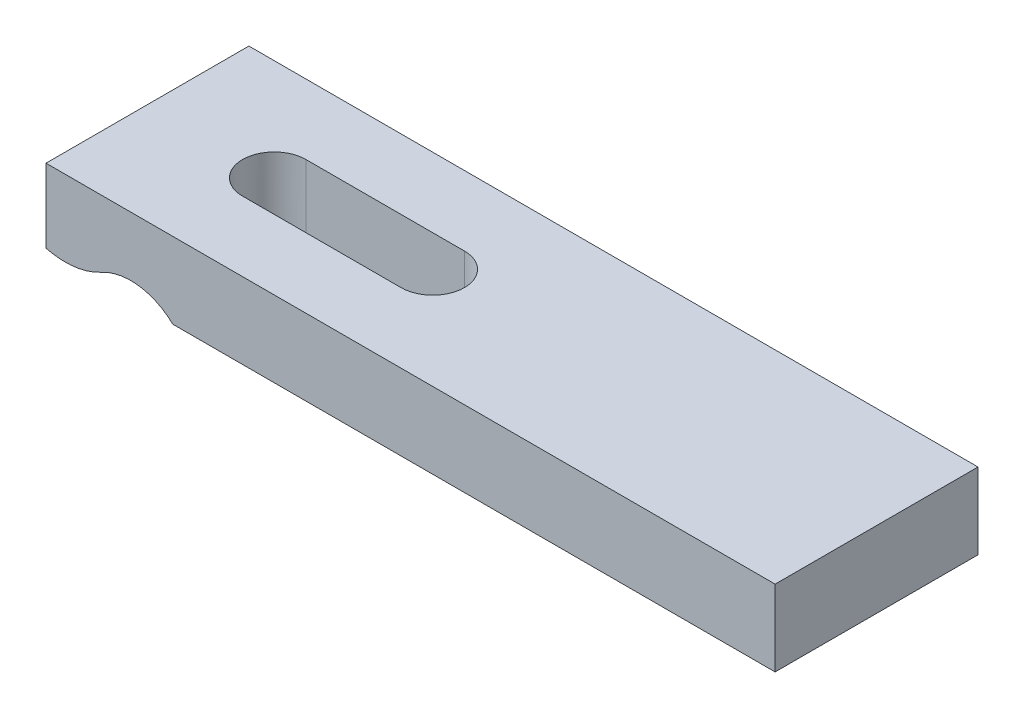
ISO-10303-21;
HEADER;
FILE_DESCRIPTION(('STEP AP214'),'2;1');
FILE_NAME('part.step','',(''),(''),'','','');
FILE_SCHEMA(('AUTOMOTIVE_DESIGN { 1 0 10303 214 1 1 1 1 }'));
ENDSEC;
DATA;
#1=APPLICATION_CONTEXT('core data for automotive mechanical design processes');
#2=APPLICATION_PROTOCOL_DEFINITION('international standard','automotive_design',2000,#1);
#3=PRODUCT_CONTEXT('',#1,'mechanical');
#4=PRODUCT('Part','Part','',(#3));
#5=PRODUCT_RELATED_PRODUCT_CATEGORY('part','',(#4));
#6=PRODUCT_DEFINITION_FORMATION('','',#4);
#7=PRODUCT_DEFINITION_CONTEXT('part definition',#1,'design');
#8=PRODUCT_DEFINITION('design','',#6,#7);
#9=PRODUCT_DEFINITION_SHAPE('','',#8);
#10=(LENGTH_UNIT() NAMED_UNIT(*) SI_UNIT(.MILLI.,.METRE.));
#11=(NAMED_UNIT(*) PLANE_ANGLE_UNIT() SI_UNIT($,.RADIAN.));
#12=(NAMED_UNIT(*) SI_UNIT($,.STERADIAN.) SOLID_ANGLE_UNIT());
#13=UNCERTAINTY_MEASURE_WITH_UNIT(LENGTH_MEASURE(1.E-05),#10,'distance_accuracy_value','');
#14=(GEOMETRIC_REPRESENTATION_CONTEXT(3) GLOBAL_UNCERTAINTY_ASSIGNED_CONTEXT((#13)) GLOBAL_UNIT_ASSIGNED_CONTEXT((#10,
#11,#12)) REPRESENTATION_CONTEXT('',''));
#15=CARTESIAN_POINT('',(0.,0.,0.));
#16=DIRECTION('',(0.,0.,1.));
#17=DIRECTION('',(1.,0.,0.));
#18=AXIS2_PLACEMENT_3D('',#15,#16,#17);
#19=CARTESIAN_POINT('',(0.,0.,32.));
#20=DIRECTION('',(1.,0.,0.));
#21=DIRECTION('',(0.,1.,0.));
#22=AXIS2_PLACEMENT_3D('',#19,#20,#21);
#23=PLANE('',#22);
#24=DIRECTION('',(0.,-1.,0.));
#25=VECTOR('',#24,1.);
#26=CARTESIAN_POINT('',(0.,0.,0.));
#27=LINE('',#26,#25);
#28=CARTESIAN_POINT('',(0.,0.,0.));
#29=VERTEX_POINT('',#28);
#30=CARTESIAN_POINT('',(0.,-11.6189500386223,0.));
#31=VERTEX_POINT('',#30);
#32=EDGE_CURVE('E161',#29,#31,#27,.T.);
#33=ORIENTED_EDGE('',*,*,#32,.T.);
#34=DIRECTION('',(0.,0.,-1.));
#35=VECTOR('',#34,1.);
#36=CARTESIAN_POINT('',(0.,-11.6189500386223,32.));
#37=LINE('',#36,#35);
#38=CARTESIAN_POINT('',(0.,-11.6189500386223,32.));
#39=VERTEX_POINT('',#38);
#40=EDGE_CURVE('E11',#39,#31,#37,.T.);
#41=ORIENTED_EDGE('',*,*,#40,.F.);
#42=DIRECTION('',(0.,-1.,0.));
#43=VECTOR('',#42,1.);
#44=CARTESIAN_POINT('',(0.,0.,32.));
#45=LINE('',#44,#43);
#46=CARTESIAN_POINT('',(0.,0.,32.));
#47=VERTEX_POINT('',#46);
#48=EDGE_CURVE('E162',#47,#39,#45,.T.);
#49=ORIENTED_EDGE('',*,*,#48,.F.);
#50=DIRECTION('',(0.,0.,-1.));
#51=VECTOR('',#50,1.);
#52=CARTESIAN_POINT('',(0.,0.,32.));
#53=LINE('',#52,#51);
#54=EDGE_CURVE('E206',#47,#29,#53,.T.);
#55=ORIENTED_EDGE('',*,*,#54,.T.);
#56=EDGE_LOOP('',(#33,#41,#49,#55));
#57=FACE_BOUND('',#56,.T.);
#58=ADVANCED_FACE('F31',(#57),#23,.F.);
#59=CARTESIAN_POINT('',(3.,0.,32.));
#60=DIRECTION('',(0.,0.,-1.));
#61=DIRECTION('',(-1.,0.,0.));
#62=AXIS2_PLACEMENT_3D('',#59,#60,#61);
#63=CYLINDRICAL_SURFACE('',#62,12.);
#64=CARTESIAN_POINT('',(3.,0.,0.));
#65=DIRECTION('',(0.,0.,1.));
#66=DIRECTION('',(1.,0.,0.));
#67=AXIS2_PLACEMENT_3D('',#64,#65,#66);
#68=CIRCLE('',#67,12.);
#69=CARTESIAN_POINT('',(8.7617013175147,-10.5262907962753,0.));
#70=VERTEX_POINT('',#69);
#71=EDGE_CURVE('E208',#31,#70,#68,.T.);
#72=ORIENTED_EDGE('',*,*,#71,.T.);
#73=DIRECTION('',(0.,0.,-1.));
#74=VECTOR('',#73,1.);
#75=CARTESIAN_POINT('',(8.7617013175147,-10.5262907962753,32.));
#76=LINE('',#75,#74);
#77=CARTESIAN_POINT('',(8.7617013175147,-10.5262907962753,32.));
#78=VERTEX_POINT('',#77);
#79=EDGE_CURVE('E38',#78,#70,#76,.T.);
#80=ORIENTED_EDGE('',*,*,#79,.F.);
#81=CARTESIAN_POINT('',(3.,0.,32.));
#82=DIRECTION('',(0.,0.,1.));
#83=DIRECTION('',(1.,0.,0.));
#84=AXIS2_PLACEMENT_3D('',#81,#82,#83);
#85=CIRCLE('',#84,12.);
#86=EDGE_CURVE('E248',#39,#78,#85,.T.);
#87=ORIENTED_EDGE('',*,*,#86,.F.);
#88=ORIENTED_EDGE('',*,*,#40,.T.);
#89=EDGE_LOOP('',(#72,#80,#87,#88));
#90=FACE_BOUND('',#89,.T.);
#91=ADVANCED_FACE('F192',(#90),#63,.T.);
#92=CARTESIAN_POINT('',(13.3710623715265,-18.9473234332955,32.));
#93=DIRECTION('',(0.,0.,-1.));
#94=DIRECTION('',(-1.,0.,0.));
#95=AXIS2_PLACEMENT_3D('',#92,#93,#94);
#96=CYLINDRICAL_SURFACE('',#95,9.6);
#97=DIRECTION('',(0.,0.,-1.));
#98=VECTOR('',#97,1.);
#99=CARTESIAN_POINT('',(19.9963696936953,-12.,32.));
#100=LINE('',#99,#98);
#101=CARTESIAN_POINT('',(19.9963696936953,-12.,11.0000013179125));
#102=VERTEX_POINT('',#101);
#103=CARTESIAN_POINT('',(19.9963696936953,-12.,0.));
#104=VERTEX_POINT('',#103);
#105=EDGE_CURVE('E231',#102,#104,#100,.T.);
#106=ORIENTED_EDGE('',*,*,#105,.F.);
#107=CARTESIAN_POINT('',(19.9963696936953,-12.,11.0000013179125));
#108=CARTESIAN_POINT('',(19.8813083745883,-11.8902365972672,11.0000797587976));
#109=CARTESIAN_POINT('',(19.7634393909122,-11.7833250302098,11.004143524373));
#110=CARTESIAN_POINT('',(19.5228037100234,-11.5756727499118,11.0213614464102));
#111=CARTESIAN_POINT('',(19.4000316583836,-11.4749391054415,11.0345258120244));
#112=CARTESIAN_POINT('',(19.1497850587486,-11.2797470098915,11.0711844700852));
#113=CARTESIAN_POINT('',(19.0222857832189,-11.1853320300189,11.0947432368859));
#114=CARTESIAN_POINT('',(18.7645717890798,-11.0040966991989,11.1532313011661));
#115=CARTESIAN_POINT('',(18.634358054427,-10.9172736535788,11.1881565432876));
#116=CARTESIAN_POINT('',(18.3716238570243,-10.7510600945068,11.2705722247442));
#117=CARTESIAN_POINT('',(18.2390933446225,-10.6717322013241,11.3181576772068));
#118=CARTESIAN_POINT('',(17.9744699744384,-10.5216616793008,11.4264170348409));
#119=CARTESIAN_POINT('',(17.8423771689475,-10.4509200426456,11.487092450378));
#120=CARTESIAN_POINT('',(17.5811148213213,-10.318486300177,11.6215873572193));
#121=CARTESIAN_POINT('',(17.4519360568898,-10.2567607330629,11.6953558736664));
#122=CARTESIAN_POINT('',(17.1980466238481,-10.1420071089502,11.856134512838));
#123=CARTESIAN_POINT('',(17.0733351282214,-10.0889774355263,11.9431421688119));
#124=CARTESIAN_POINT('',(16.8480314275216,-9.99840007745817,12.1164104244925));
#125=CARTESIAN_POINT('',(16.7465640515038,-9.95972245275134,12.2009498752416));
#126=CARTESIAN_POINT('',(16.5495654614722,-9.88817895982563,12.3789341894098));
#127=CARTESIAN_POINT('',(16.4540339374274,-9.8553127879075,12.4723785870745));
#128=CARTESIAN_POINT('',(16.2699197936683,-9.7949452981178,12.6676541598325));
#129=CARTESIAN_POINT('',(16.1813437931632,-9.76744905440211,12.7694931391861));
#130=CARTESIAN_POINT('',(16.0122104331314,-9.7173657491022,12.9807545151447));
#131=CARTESIAN_POINT('',(15.931653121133,-9.69477871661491,13.0901769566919));
#132=CARTESIAN_POINT('',(15.7825603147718,-9.6548325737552,13.3110934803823));
#133=CARTESIAN_POINT('',(15.7136643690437,-9.63729522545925,13.4223125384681));
#134=CARTESIAN_POINT('',(15.5846008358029,-9.60576768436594,13.6502325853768));
#135=CARTESIAN_POINT('',(15.5244361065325,-9.59177865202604,13.7669353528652));
#136=CARTESIAN_POINT('',(15.4134043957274,-9.56691429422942,14.0049131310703));
#137=CARTESIAN_POINT('',(15.362531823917,-9.55603709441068,14.126185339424));
#138=CARTESIAN_POINT('',(15.2704280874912,-9.53697681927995,14.3725920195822));
#139=CARTESIAN_POINT('',(15.2292005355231,-9.52879475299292,14.497727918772));
#140=CARTESIAN_POINT('',(15.1556918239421,-9.51458570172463,14.7545968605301));
#141=CARTESIAN_POINT('',(15.123699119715,-9.50862678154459,14.8864162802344));
#142=CARTESIAN_POINT('',(15.0705103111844,-9.49890513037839,15.1523414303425));
#143=CARTESIAN_POINT('',(15.0493180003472,-9.49514317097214,15.2864479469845));
#144=CARTESIAN_POINT('',(15.0179061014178,-9.48961965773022,15.5559843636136));
#145=CARTESIAN_POINT('',(15.007686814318,-9.48785815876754,15.6914142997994));
#146=CARTESIAN_POINT('',(14.9982979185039,-9.48623855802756,15.9626683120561));
#147=CARTESIAN_POINT('',(14.9991284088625,-9.4863804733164,16.0984923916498));
#148=CARTESIAN_POINT('',(15.011953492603,-9.48859622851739,16.3721685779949));
#149=CARTESIAN_POINT('',(15.024158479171,-9.49070647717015,16.5100105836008));
#150=CARTESIAN_POINT('',(15.0599331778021,-9.49703008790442,16.7841152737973));
#151=CARTESIAN_POINT('',(15.0834990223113,-9.50124273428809,16.9203784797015));
#152=CARTESIAN_POINT('',(15.1418193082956,-9.51200157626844,17.1904503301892));
#153=CARTESIAN_POINT('',(15.1765779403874,-9.51854864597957,17.3242580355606));
#154=CARTESIAN_POINT('',(15.2569836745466,-9.53430176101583,17.5883450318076));
#155=CARTESIAN_POINT('',(15.3026265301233,-9.54350676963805,17.7186256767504));
#156=CARTESIAN_POINT('',(15.4043334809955,-9.56497281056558,17.9745312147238));
#157=CARTESIAN_POINT('',(15.4603792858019,-9.57722849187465,18.1001638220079));
#158=CARTESIAN_POINT('',(15.5824229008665,-9.60527863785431,18.346026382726));
#159=CARTESIAN_POINT('',(15.6484167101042,-9.62107168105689,18.4662584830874));
#160=CARTESIAN_POINT('',(15.7897621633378,-9.65672594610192,18.700483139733));
#161=CARTESIAN_POINT('',(15.8651151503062,-9.67658775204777,18.8144747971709));
#162=CARTESIAN_POINT('',(16.0244150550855,-9.72091833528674,19.0353354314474));
#163=CARTESIAN_POINT('',(16.1083617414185,-9.74538698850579,19.1422046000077));
#164=CARTESIAN_POINT('',(16.2818469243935,-9.79880612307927,19.3455597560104));
#165=CARTESIAN_POINT('',(16.3712030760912,-9.82763507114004,19.442233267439));
#166=CARTESIAN_POINT('',(16.5562901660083,-9.89062005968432,19.6273953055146));
#167=CARTESIAN_POINT('',(16.6520209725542,-9.92477599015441,19.7158840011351));
#168=CARTESIAN_POINT('',(16.848699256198,-9.99874439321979,19.8840740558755));
#169=CARTESIAN_POINT('',(16.9496418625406,-10.0385516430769,19.9637834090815));
#170=CARTESIAN_POINT('',(17.1556744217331,-10.1241068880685,20.1141311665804));
#171=CARTESIAN_POINT('',(17.2607643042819,-10.1698547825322,20.1847697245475));
#172=CARTESIAN_POINT('',(17.4714399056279,-10.2663088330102,20.3152500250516));
#173=CARTESIAN_POINT('',(17.5769584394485,-10.3168764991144,20.3753029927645));
#174=CARTESIAN_POINT('',(17.7897433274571,-10.4238591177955,20.4865561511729));
#175=CARTESIAN_POINT('',(17.8970103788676,-10.4802764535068,20.5377527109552));
#176=CARTESIAN_POINT('',(18.1123937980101,-10.5989747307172,20.6314972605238));
#177=CARTESIAN_POINT('',(18.220511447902,-10.6612673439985,20.6740274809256));
#178=CARTESIAN_POINT('',(18.436343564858,-10.791417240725,20.7505882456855));
#179=CARTESIAN_POINT('',(18.5440581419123,-10.8592728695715,20.784621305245));
#180=CARTESIAN_POINT('',(18.7689641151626,-11.0073894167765,20.8476304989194));
#181=CARTESIAN_POINT('',(18.8860231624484,-11.088212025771,20.8757577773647));
#182=CARTESIAN_POINT('',(19.1176270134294,-11.2559350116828,20.9229455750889));
#183=CARTESIAN_POINT('',(19.2321709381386,-11.3428374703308,20.9420029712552));
#184=CARTESIAN_POINT('',(19.4574019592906,-11.5218897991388,20.9717642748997));
#185=CARTESIAN_POINT('',(19.5681029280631,-11.6140167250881,20.982502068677));
#186=CARTESIAN_POINT('',(19.7854219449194,-11.8033173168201,20.9965795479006));
#187=CARTESIAN_POINT('',(19.8920436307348,-11.900486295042,20.9999259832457));
#188=CARTESIAN_POINT('',(19.9963696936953,-12.,20.9999986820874));
#189=B_SPLINE_CURVE_WITH_KNOTS('',3,(#107,#108,#109,#110,#111,#112,#113,#114,#115,#116,#117,
#118,#119,#120,#121,#122,#123,#124,#125,#126,#127,#128,#129,#130,#131,#132,#133,#134,#135,#136,
#137,#138,#139,#140,#141,#142,#143,#144,#145,#146,#147,#148,#149,#150,#151,#152,#153,#154,#155,
#156,#157,#158,#159,#160,#161,#162,#163,#164,#165,#166,#167,#168,#169,#170,#171,#172,#173,#174,
#175,#176,#177,#178,#179,#180,#181,#182,#183,#184,#185,#186,#187,#188),.UNSPECIFIED.,.F.,.F.,(4,
2,2,2,2,2,2,2,2,2,2,2,2,2,2,2,2,2,2,2,2,2,2,2,2,2,2,2,2,2,2,2,2,2,2,2,2,2,2,2,4),(0.,
0.477056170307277,0.954648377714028,1.43524557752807,1.91567149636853,2.39980995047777,
2.88400429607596,3.36635332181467,3.84861258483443,4.26094157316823,4.67324900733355,
5.08594417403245,5.49864178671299,5.89419032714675,6.28986806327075,6.68530696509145,
7.08089374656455,7.48775461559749,7.8947582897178,8.30177312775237,8.70879161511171,
9.12349135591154,9.5380500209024,9.95276407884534,10.3673165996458,10.7811470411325,
11.1948114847,11.6085353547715,12.0222480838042,12.4260408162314,12.8298252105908,
13.23323884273,13.6366456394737,14.0307598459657,14.4250352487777,14.8201111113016,
15.2150698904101,15.6496187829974,16.0843171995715,16.5172356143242,16.9497585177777),.UNSPECIFIED.);
#190=CARTESIAN_POINT('',(19.9963696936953,-12.,20.9999986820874));
#191=VERTEX_POINT('',#190);
#192=EDGE_CURVE('E151',#102,#191,#189,.T.);
#193=ORIENTED_EDGE('',*,*,#192,.T.);
#194=CARTESIAN_POINT('',(19.9963696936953,-12.,32.));
#195=VERTEX_POINT('',#194);
#196=EDGE_CURVE('E134',#195,#191,#100,.T.);
#197=ORIENTED_EDGE('',*,*,#196,.F.);
#198=CARTESIAN_POINT('',(13.3710623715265,-18.9473234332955,32.));
#199=DIRECTION('',(0.,0.,-1.));
#200=DIRECTION('',(-1.,0.,0.));
#201=AXIS2_PLACEMENT_3D('',#198,#199,#200);
#202=CIRCLE('',#201,9.6);
#203=EDGE_CURVE('E238',#78,#195,#202,.T.);
#204=ORIENTED_EDGE('',*,*,#203,.F.);
#205=ORIENTED_EDGE('',*,*,#79,.T.);
#206=CARTESIAN_POINT('',(13.3710623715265,-18.9473234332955,0.));
#207=DIRECTION('',(0.,0.,-1.));
#208=DIRECTION('',(-1.,0.,0.));
#209=AXIS2_PLACEMENT_3D('',#206,#207,#208);
#210=CIRCLE('',#209,9.6);
#211=EDGE_CURVE('E210',#70,#104,#210,.T.);
#212=ORIENTED_EDGE('',*,*,#211,.T.);
#213=EDGE_LOOP('',(#106,#193,#197,#204,#205,#212));
#214=FACE_BOUND('',#213,.T.);
#215=ADVANCED_FACE('F164',(#214),#96,.F.);
#216=CARTESIAN_POINT('',(19.9963696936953,-12.,32.));
#217=DIRECTION('',(0.,1.,0.));
#218=DIRECTION('',(0.,0.,1.));
#219=AXIS2_PLACEMENT_3D('',#216,#217,#218);
#220=PLANE('',#219);
#221=DIRECTION('',(-1.,0.,0.));
#222=VECTOR('',#221,1.);
#223=CARTESIAN_POINT('',(20.,-12.,11.));
#224=LINE('',#223,#222);
#225=CARTESIAN_POINT('',(45.,-12.,11.));
#226=VERTEX_POINT('',#225);
#227=CARTESIAN_POINT('',(20.,-12.,11.));
#228=VERTEX_POINT('',#227);
#229=EDGE_CURVE('E121',#226,#228,#224,.T.);
#230=ORIENTED_EDGE('',*,*,#229,.T.);
#231=CARTESIAN_POINT('',(20.,-12.,16.));
#232=DIRECTION('',(0.,1.,0.));
#233=DIRECTION('',(0.,0.,1.));
#234=AXIS2_PLACEMENT_3D('',#231,#232,#233);
#235=CIRCLE('',#234,5.);
#236=EDGE_CURVE('E127',#228,#102,#235,.T.);
#237=ORIENTED_EDGE('',*,*,#236,.T.);
#238=ORIENTED_EDGE('',*,*,#105,.T.);
#239=DIRECTION('',(1.,0.,0.));
#240=VECTOR('',#239,1.);
#241=CARTESIAN_POINT('',(19.9963696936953,-12.,0.));
#242=LINE('',#241,#240);
#243=CARTESIAN_POINT('',(115.,-12.,0.));
#244=VERTEX_POINT('',#243);
#245=EDGE_CURVE('E218',#104,#244,#242,.T.);
#246=ORIENTED_EDGE('',*,*,#245,.T.);
#247=DIRECTION('',(0.,0.,-1.));
#248=VECTOR('',#247,1.);
#249=CARTESIAN_POINT('',(115.,-12.,32.));
#250=LINE('',#249,#248);
#251=CARTESIAN_POINT('',(115.,-12.,32.));
#252=VERTEX_POINT('',#251);
#253=EDGE_CURVE('E228',#252,#244,#250,.T.);
#254=ORIENTED_EDGE('',*,*,#253,.F.);
#255=DIRECTION('',(1.,0.,0.));
#256=VECTOR('',#255,1.);
#257=CARTESIAN_POINT('',(19.9963696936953,-12.,32.));
#258=LINE('',#257,#256);
#259=EDGE_CURVE('E245',#195,#252,#258,.T.);
#260=ORIENTED_EDGE('',*,*,#259,.F.);
#261=ORIENTED_EDGE('',*,*,#196,.T.);
#262=CARTESIAN_POINT('',(20.,-12.,21.));
#263=VERTEX_POINT('',#262);
#264=EDGE_CURVE('E115',#191,#263,#235,.T.);
#265=ORIENTED_EDGE('',*,*,#264,.T.);
#266=DIRECTION('',(1.,0.,0.));
#267=VECTOR('',#266,1.);
#268=CARTESIAN_POINT('',(20.,-12.,21.));
#269=LINE('',#268,#267);
#270=CARTESIAN_POINT('',(45.,-12.,21.));
#271=VERTEX_POINT('',#270);
#272=EDGE_CURVE('E124',#263,#271,#269,.T.);
#273=ORIENTED_EDGE('',*,*,#272,.T.);
#274=CARTESIAN_POINT('',(45.,-12.,16.));
#275=DIRECTION('',(0.,1.,0.));
#276=DIRECTION('',(0.,0.,1.));
#277=AXIS2_PLACEMENT_3D('',#274,#275,#276);
#278=CIRCLE('',#277,5.);
#279=EDGE_CURVE('E45',#271,#226,#278,.T.);
#280=ORIENTED_EDGE('',*,*,#279,.T.);
#281=EDGE_LOOP('',(#230,#237,#238,#246,#254,#260,#261,#265,#273,#280));
#282=FACE_BOUND('',#281,.T.);
#283=ADVANCED_FACE('F131',(#282),#220,.F.);
#284=CARTESIAN_POINT('',(115.,0.,32.));
#285=DIRECTION('',(-1.,0.,0.));
#286=DIRECTION('',(0.,0.,1.));
#287=AXIS2_PLACEMENT_3D('',#284,#285,#286);
#288=PLANE('',#287);
#289=DIRECTION('',(0.,1.,0.));
#290=VECTOR('',#289,1.);
#291=CARTESIAN_POINT('',(115.,0.,0.));
#292=LINE('',#291,#290);
#293=CARTESIAN_POINT('',(115.,0.,0.));
#294=VERTEX_POINT('',#293);
#295=EDGE_CURVE('E220',#244,#294,#292,.T.);
#296=ORIENTED_EDGE('',*,*,#295,.T.);
#297=DIRECTION('',(0.,0.,-1.));
#298=VECTOR('',#297,1.);
#299=CARTESIAN_POINT('',(115.,0.,32.));
#300=LINE('',#299,#298);
#301=CARTESIAN_POINT('',(115.,0.,32.));
#302=VERTEX_POINT('',#301);
#303=EDGE_CURVE('E225',#302,#294,#300,.T.);
#304=ORIENTED_EDGE('',*,*,#303,.F.);
#305=DIRECTION('',(0.,1.,0.));
#306=VECTOR('',#305,1.);
#307=CARTESIAN_POINT('',(115.,0.,32.));
#308=LINE('',#307,#306);
#309=EDGE_CURVE('E243',#252,#302,#308,.T.);
#310=ORIENTED_EDGE('',*,*,#309,.F.);
#311=ORIENTED_EDGE('',*,*,#253,.T.);
#312=EDGE_LOOP('',(#296,#304,#310,#311));
#313=FACE_BOUND('',#312,.T.);
#314=ADVANCED_FACE('F184',(#313),#288,.F.);
#315=CARTESIAN_POINT('',(0.,0.,32.));
#316=DIRECTION('',(0.,-1.,0.));
#317=DIRECTION('',(0.,0.,-1.));
#318=AXIS2_PLACEMENT_3D('',#315,#316,#317);
#319=PLANE('',#318);
#320=DIRECTION('',(1.,0.,0.));
#321=VECTOR('',#320,1.);
#322=CARTESIAN_POINT('',(20.,0.,21.));
#323=LINE('',#322,#321);
#324=CARTESIAN_POINT('',(20.,0.,21.));
#325=VERTEX_POINT('',#324);
#326=CARTESIAN_POINT('',(45.,0.,21.));
#327=VERTEX_POINT('',#326);
#328=EDGE_CURVE('E145',#325,#327,#323,.T.);
#329=ORIENTED_EDGE('',*,*,#328,.F.);
#330=CARTESIAN_POINT('',(20.,0.,16.));
#331=DIRECTION('',(0.,1.,0.));
#332=DIRECTION('',(0.,0.,1.));
#333=AXIS2_PLACEMENT_3D('',#330,#331,#332);
#334=CIRCLE('',#333,5.);
#335=CARTESIAN_POINT('',(20.,0.,11.));
#336=VERTEX_POINT('',#335);
#337=EDGE_CURVE('E53',#336,#325,#334,.T.);
#338=ORIENTED_EDGE('',*,*,#337,.F.);
#339=DIRECTION('',(-1.,0.,0.));
#340=VECTOR('',#339,1.);
#341=CARTESIAN_POINT('',(20.,0.,11.));
#342=LINE('',#341,#340);
#343=CARTESIAN_POINT('',(45.,0.,11.));
#344=VERTEX_POINT('',#343);
#345=EDGE_CURVE('E135',#344,#336,#342,.T.);
#346=ORIENTED_EDGE('',*,*,#345,.F.);
#347=CARTESIAN_POINT('',(45.,0.,16.));
#348=DIRECTION('',(0.,1.,0.));
#349=DIRECTION('',(0.,0.,1.));
#350=AXIS2_PLACEMENT_3D('',#347,#348,#349);
#351=CIRCLE('',#350,5.);
#352=EDGE_CURVE('E139',#327,#344,#351,.T.);
#353=ORIENTED_EDGE('',*,*,#352,.F.);
#354=EDGE_LOOP('',(#329,#338,#346,#353));
#355=FACE_BOUND('',#354,.T.);
#356=DIRECTION('',(-1.,0.,0.));
#357=VECTOR('',#356,1.);
#358=CARTESIAN_POINT('',(0.,0.,0.));
#359=LINE('',#358,#357);
#360=EDGE_CURVE('E222',#294,#29,#359,.T.);
#361=ORIENTED_EDGE('',*,*,#360,.T.);
#362=ORIENTED_EDGE('',*,*,#54,.F.);
#363=DIRECTION('',(-1.,0.,0.));
#364=VECTOR('',#363,1.);
#365=CARTESIAN_POINT('',(0.,0.,32.));
#366=LINE('',#365,#364);
#367=EDGE_CURVE('E213',#302,#47,#366,.T.);
#368=ORIENTED_EDGE('',*,*,#367,.F.);
#369=ORIENTED_EDGE('',*,*,#303,.T.);
#370=EDGE_LOOP('',(#361,#362,#368,#369));
#371=FACE_BOUND('',#370,.T.);
#372=ADVANCED_FACE('F177',(#355,#371),#319,.F.);
#373=CARTESIAN_POINT('',(3.,0.,32.));
#374=DIRECTION('',(0.,0.,1.));
#375=DIRECTION('',(1.,0.,0.));
#376=AXIS2_PLACEMENT_3D('',#373,#374,#375);
#377=PLANE('',#376);
#378=ORIENTED_EDGE('',*,*,#48,.T.);
#379=ORIENTED_EDGE('',*,*,#86,.T.);
#380=ORIENTED_EDGE('',*,*,#203,.T.);
#381=ORIENTED_EDGE('',*,*,#259,.T.);
#382=ORIENTED_EDGE('',*,*,#309,.T.);
#383=ORIENTED_EDGE('',*,*,#367,.T.);
#384=EDGE_LOOP('',(#378,#379,#380,#381,#382,#383));
#385=FACE_BOUND('',#384,.T.);
#386=ADVANCED_FACE('F174',(#385),#377,.T.);
#387=CARTESIAN_POINT('',(3.,0.,0.));
#388=DIRECTION('',(0.,0.,1.));
#389=DIRECTION('',(1.,0.,0.));
#390=AXIS2_PLACEMENT_3D('',#387,#388,#389);
#391=PLANE('',#390);
#392=ORIENTED_EDGE('',*,*,#32,.F.);
#393=ORIENTED_EDGE('',*,*,#360,.F.);
#394=ORIENTED_EDGE('',*,*,#295,.F.);
#395=ORIENTED_EDGE('',*,*,#245,.F.);
#396=ORIENTED_EDGE('',*,*,#211,.F.);
#397=ORIENTED_EDGE('',*,*,#71,.F.);
#398=EDGE_LOOP('',(#392,#393,#394,#395,#396,#397));
#399=FACE_BOUND('',#398,.T.);
#400=ADVANCED_FACE('F172',(#399),#391,.F.);
#401=CARTESIAN_POINT('',(20.,-12.,16.));
#402=DIRECTION('',(0.,1.,0.));
#403=DIRECTION('',(0.,0.,1.));
#404=AXIS2_PLACEMENT_3D('',#401,#402,#403);
#405=CYLINDRICAL_SURFACE('',#404,5.);
#406=ORIENTED_EDGE('',*,*,#236,.F.);
#407=DIRECTION('',(0.,1.,0.));
#408=VECTOR('',#407,1.);
#409=CARTESIAN_POINT('',(20.,-12.,11.));
#410=LINE('',#409,#408);
#411=EDGE_CURVE('E149',#228,#336,#410,.T.);
#412=ORIENTED_EDGE('',*,*,#411,.T.);
#413=ORIENTED_EDGE('',*,*,#337,.T.);
#414=DIRECTION('',(0.,1.,0.));
#415=VECTOR('',#414,1.);
#416=CARTESIAN_POINT('',(20.,-12.,21.));
#417=LINE('',#416,#415);
#418=EDGE_CURVE('E110',#263,#325,#417,.T.);
#419=ORIENTED_EDGE('',*,*,#418,.F.);
#420=ORIENTED_EDGE('',*,*,#264,.F.);
#421=ORIENTED_EDGE('',*,*,#192,.F.);
#422=EDGE_LOOP('',(#406,#412,#413,#419,#420,#421));
#423=FACE_BOUND('',#422,.T.);
#424=ADVANCED_FACE('F113',(#423),#405,.F.);
#425=CARTESIAN_POINT('',(20.,-12.,11.));
#426=DIRECTION('',(0.,0.,-1.));
#427=DIRECTION('',(-1.,0.,0.));
#428=AXIS2_PLACEMENT_3D('',#425,#426,#427);
#429=PLANE('',#428);
#430=ORIENTED_EDGE('',*,*,#345,.T.);
#431=ORIENTED_EDGE('',*,*,#411,.F.);
#432=ORIENTED_EDGE('',*,*,#229,.F.);
#433=DIRECTION('',(0.,1.,0.));
#434=VECTOR('',#433,1.);
#435=CARTESIAN_POINT('',(45.,-12.,11.));
#436=LINE('',#435,#434);
#437=EDGE_CURVE('E152',#226,#344,#436,.T.);
#438=ORIENTED_EDGE('',*,*,#437,.T.);
#439=EDGE_LOOP('',(#430,#431,#432,#438));
#440=FACE_BOUND('',#439,.T.);
#441=ADVANCED_FACE('F171',(#440),#429,.F.);
#442=CARTESIAN_POINT('',(45.,-12.,16.));
#443=DIRECTION('',(0.,1.,0.));
#444=DIRECTION('',(0.,0.,1.));
#445=AXIS2_PLACEMENT_3D('',#442,#443,#444);
#446=CYLINDRICAL_SURFACE('',#445,5.);
#447=ORIENTED_EDGE('',*,*,#352,.T.);
#448=ORIENTED_EDGE('',*,*,#437,.F.);
#449=ORIENTED_EDGE('',*,*,#279,.F.);
#450=DIRECTION('',(0.,1.,0.));
#451=VECTOR('',#450,1.);
#452=CARTESIAN_POINT('',(45.,-12.,21.));
#453=LINE('',#452,#451);
#454=EDGE_CURVE('E120',#271,#327,#453,.T.);
#455=ORIENTED_EDGE('',*,*,#454,.T.);
#456=EDGE_LOOP('',(#447,#448,#449,#455));
#457=FACE_BOUND('',#456,.T.);
#458=ADVANCED_FACE('F255',(#457),#446,.F.);
#459=CARTESIAN_POINT('',(20.,-12.,21.));
#460=DIRECTION('',(0.,0.,1.));
#461=DIRECTION('',(1.,0.,0.));
#462=AXIS2_PLACEMENT_3D('',#459,#460,#461);
#463=PLANE('',#462);
#464=ORIENTED_EDGE('',*,*,#328,.T.);
#465=ORIENTED_EDGE('',*,*,#454,.F.);
#466=ORIENTED_EDGE('',*,*,#272,.F.);
#467=ORIENTED_EDGE('',*,*,#418,.T.);
#468=EDGE_LOOP('',(#464,#465,#466,#467));
#469=FACE_BOUND('',#468,.T.);
#470=ADVANCED_FACE('F125',(#469),#463,.F.);
#471=CLOSED_SHELL('',(#58,#91,#215,#283,#314,#372,#386,#400,#424,#441,#458,#470));
#472=MANIFOLD_SOLID_BREP('B2',#471);
#473=ADVANCED_BREP_SHAPE_REPRESENTATION('',(#18,#472),#14);
#474=SHAPE_DEFINITION_REPRESENTATION(#9,#473);
ENDSEC;
END-ISO-10303-21;
